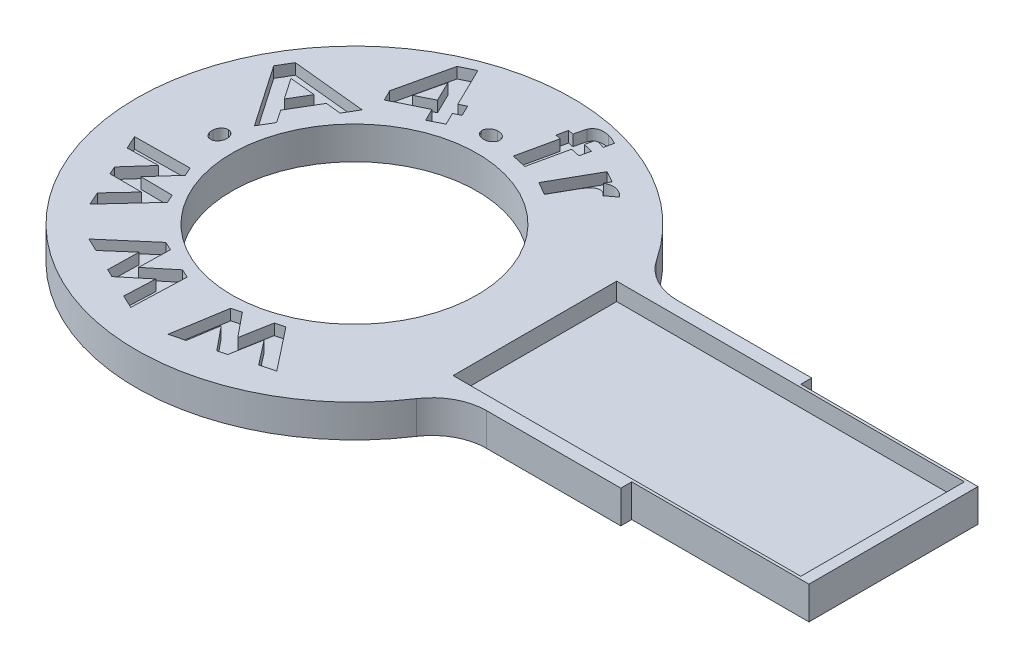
from build123d import *

# Parameters (mm, degrees)
BOSS_EXTRU_1_DEPTH      = 2.4
ESQUISSE2_W             = 25.5
ESQUISSE2_H             = 12
ENL_V_MAT_EXTRU_1_DEPTH = 1.3
ESQUISSE3_R             = 9
ENL_V_MAT_EXTRU_2_DEPTH = 35.559151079
ENL_V_MAT_EXTRU_3_DEPTH = 0.8
CONG_1_R                = 4


with BuildPart() as part:
    # Esquisse1 → Boss.-Extru.1 (new body)
    with BuildSketch(Plane(origin=(0, 0, 0), x_dir=(1, 0, 0), z_dir=(0, 1, 0))):
        with BuildLine():
            Line((25, 6.2), (25, -6.2))
            Line((25, -6.2), (12, -6.2))
            Line((12, -6.2), (12, -7))
            Line((12, -7), (-0.150595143, -7))
            ThreePointArc((-0.150595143, -7), (-30.538089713, 0), (-0.150595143, 7))
            Line((-0.150595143, 7), (12, 7))
            Line((12, 7), (12, 6.2))
            Line((12, 6.2), (25, 6.2))
        make_face()
    extrude(amount=-BOSS_EXTRU_1_DEPTH)

    # Esquisse2 → Enl_v. mat.-Extru.1 (cut)
    with BuildSketch(Plane(origin=(0, 0, 0), x_dir=(1, 0, 0), z_dir=(0, 1, 0))):
        with Locations((11.45, 0)):
            Rectangle(ESQUISSE2_W, ESQUISSE2_H)
    extrude(amount=-ENL_V_MAT_EXTRU_1_DEPTH, mode=Mode.SUBTRACT)

    # Esquisse3 → Enl_v. mat.-Extru.2 (cut, through all)
    with BuildSketch(Plane(origin=(0, 0, 0), x_dir=(1, 0, 0), z_dir=(0, 1, 0))):
        with Locations(Location((-14.538089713, 0, 0), (0, 0, 270))):
            Circle(ESQUISSE3_R)
    extrude(amount=-ENL_V_MAT_EXTRU_2_DEPTH, mode=Mode.SUBTRACT)

    # Esquisse4 → Enl_v. mat.-Extru.3 (cut)
    # profile 1 of 9: a face of its own
    with BuildSketch(Plane(origin=(0, 0, 0), x_dir=(1, 0, 0), z_dir=(0, 1, 0))):
        with BuildLine():
            Line((-8.606236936, 12.602438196), (-7.777911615, 12.133688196))
            Line((-7.777911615, 12.133688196), (-8.006277, 11.731043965))
            add(Edge.make_bspline(
                [(-8.006277, 11.731043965), (-7.961465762, 11.75596998), (-7.873407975, 11.80495166), (-7.733124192, 11.856415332), (-7.5896155, 11.885673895), (-7.444633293, 11.894720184), (-7.299841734, 11.88330426), (-7.157653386, 11.853811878), (-7.017942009, 11.807405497), (-6.930657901, 11.761358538), (-6.886485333, 11.738055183)],
                knots=[0, 0, 0, 0, 1.045225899, 2.053955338, 3.034687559, 4.024465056, 5.008386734, 5.989118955, 6.982337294, 8, 8, 8, 8], degree=3))
            add(Edge.make_bspline(
                [(-6.886485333, 11.738055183), (-6.855318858, 11.719009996), (-6.79208697, 11.6803703), (-6.703704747, 11.608791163), (-6.618254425, 11.526932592), (-6.566412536, 11.465135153), (-6.539930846, 11.433568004)],
                knots=[0, 0, 0, 0, 0.943863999, 1.914952, 2.934923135, 4, 4, 4, 4], degree=3))
            Line((-6.539930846, 11.433568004), (-7.232038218, 10.91273467))
            add(Edge.make_bspline(
                [(-7.232038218, 10.91273467), (-7.252975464, 10.938826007), (-7.292250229, 10.987768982), (-7.354261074, 11.051304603), (-7.41214917, 11.103613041), (-7.453360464, 11.129244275), (-7.472422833, 11.141100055)],
                knots=[0, 0, 0, 0, 1.202976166, 2.256581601, 3.193578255, 4, 4, 4, 4], degree=3))
            add(Edge.make_bspline(
                [(-7.472422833, 11.141100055), (-7.490875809, 11.150683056), (-7.527726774, 11.169820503), (-7.587030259, 11.188215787), (-7.647840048, 11.199847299), (-7.710692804, 11.201770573), (-7.775063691, 11.193875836), (-7.841806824, 11.180284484), (-7.910153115, 11.156516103), (-7.981188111, 11.124416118), (-8.054726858, 11.079413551), (-8.130086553, 11.017889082), (-8.208757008, 10.940726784), (-8.289977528, 10.846585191), (-8.373672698, 10.736143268), (-8.460748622, 10.609182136), (-8.551896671, 10.466554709), (-8.610679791, 10.364118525), (-8.641293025, 10.310771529)],
                knots=[0, 0, 0, 0, 0.626750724, 1.251633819, 1.866598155, 2.491968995, 3.141025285, 3.821201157, 4.544887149, 5.320826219, 6.171494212, 7.139779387, 8.251934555, 9.495259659, 10.890575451, 12.434212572, 14.142999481, 16, 16, 16, 16], degree=3))
            Line((-8.641293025, 10.310771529), (-8.726429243, 10.154521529))
            Line((-8.726429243, 10.154521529), (-9.458600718, 8.859449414))
            Line((-9.458600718, 8.859449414), (-10.417134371, 9.401316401))
            Line((-10.417134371, 9.401316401), (-8.606236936, 12.602438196))
        make_face()
    # profile 2 of 9: a face of its own
    with BuildSketch(Plane(origin=(0, 0, 0), x_dir=(1, 0, 0), z_dir=(0, 1, 0))):
        with BuildLine():
            Line((-12.636736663, 13.811610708), (-12.251119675, 13.72647449))
            add(Edge.make_bspline(
                [(-12.251119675, 13.72647449), (-12.238376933, 13.78188322), (-12.214271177, 13.886701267), (-12.180995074, 14.035281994), (-12.148265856, 14.165508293), (-12.120602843, 14.277772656), (-12.097004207, 14.37224839), (-12.074487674, 14.447710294), (-12.057478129, 14.506294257), (-12.044953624, 14.538496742), (-12.039781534, 14.551795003)],
                knots=[0, 0, 0, 0, 1.600764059, 3.028204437, 4.286682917, 5.381007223, 6.283848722, 7.027579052, 7.598431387, 8, 8, 8, 8], degree=3))
            add(Edge.make_bspline(
                [(-12.039781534, 14.551795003), (-12.030221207, 14.575041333), (-12.011503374, 14.620554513), (-11.975766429, 14.684850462), (-11.933877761, 14.74342178), (-11.886617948, 14.797262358), (-11.832810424, 14.844596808), (-11.773521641, 14.886505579), (-11.708702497, 14.924224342), (-11.637779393, 14.955718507), (-11.561342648, 14.982588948), (-11.478745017, 14.999615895), (-11.39112582, 15.012054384), (-11.29829712, 15.016784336), (-11.199978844, 15.014169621), (-11.096173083, 15.00673641), (-10.986978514, 14.990015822), (-10.912918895, 14.975108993), (-10.874917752, 14.967460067)],
                knots=[0, 0, 0, 0, 0.886170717, 1.735002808, 2.587992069, 3.422318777, 4.256645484, 5.109634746, 5.980329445, 6.897576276, 7.843634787, 8.832424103, 9.866809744, 10.963743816, 12.106450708, 13.334979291, 14.632536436, 16, 16, 16, 16], degree=3))
            add(Edge.make_bspline(
                [(-10.874917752, 14.967460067), (-10.81683825, 14.953172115), (-10.696667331, 14.923609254), (-10.516505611, 14.856384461), (-10.328591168, 14.773569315), (-10.204076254, 14.706592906), (-10.13974147, 14.67198731)],
                knots=[0, 0, 0, 0, 0.902164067, 1.866646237, 2.897731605, 4, 4, 4, 4], degree=3))
            Line((-10.13974147, 14.67198731), (-10.289981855, 13.988894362))
            add(Edge.make_bspline(
                [(-10.289981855, 13.988894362), (-10.32562779, 14.005092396), (-10.393165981, 14.035782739), (-10.490445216, 14.076804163), (-10.579516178, 14.107254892), (-10.636769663, 14.121463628), (-10.663579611, 14.128117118)],
                knots=[0, 0, 0, 0, 1.176179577, 2.228502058, 3.170465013, 4, 4, 4, 4], degree=3))
            add(Edge.make_bspline(
                [(-10.663579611, 14.128117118), (-10.693191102, 14.134346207), (-10.748705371, 14.146024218), (-10.827760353, 14.149269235), (-10.896926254, 14.145926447), (-10.936557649, 14.131050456), (-10.955045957, 14.124110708)],
                knots=[0, 0, 0, 0, 1.223562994, 2.293879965, 3.204083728, 4, 4, 4, 4], degree=3))
            add(Edge.make_bspline(
                [(-10.955045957, 14.124110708), (-10.967342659, 14.116449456), (-10.993933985, 14.099882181), (-11.023571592, 14.056806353), (-11.04704931, 14.000379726), (-11.058140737, 13.957378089), (-11.064220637, 13.933806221)],
                knots=[0, 0, 0, 0, 0.761870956, 1.647527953, 2.710463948, 4, 4, 4, 4], degree=3))
            Line((-11.064220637, 13.933806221), (-11.166384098, 13.48809308))
            Line((-11.166384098, 13.48809308), (-10.478283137, 13.336851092))
            Line((-10.478283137, 13.336851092), (-10.645550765, 12.574631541))
            Line((-10.645550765, 12.574631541), (-11.333651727, 12.725873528))
            Line((-11.333651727, 12.725873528), (-11.952642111, 9.912371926))
            Line((-11.952642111, 9.912371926), (-13.037377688, 10.150753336))
            Line((-13.037377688, 10.150753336), (-12.418387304, 12.964254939))
            Line((-12.418387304, 12.964254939), (-12.804004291, 13.049391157))
            Line((-12.804004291, 13.049391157), (-12.636736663, 13.811610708))
        make_face()
    # profile 3 of 9: a face of its own
    with BuildSketch(Plane(origin=(0, 0, 0), x_dir=(1, 0, 0), z_dir=(0, 1, 0))):
        with BuildLine():
            add(Edge.make_bspline(
                [(-15.209833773, 11.179592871), (-15.166996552, 11.180896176), (-15.083660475, 11.183431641), (-14.962435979, 11.159750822), (-14.849433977, 11.118971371), (-14.748098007, 11.057667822), (-14.661242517, 10.983189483), (-14.594564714, 10.895997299), (-14.551589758, 10.797468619), (-14.543065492, 10.727268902), (-14.538760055, 10.691812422)],
                knots=[0, 0, 0, 0, 1.114239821, 2.167656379, 3.197687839, 4.232233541, 5.237809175, 6.163994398, 7.072670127, 8, 8, 8, 8], degree=3))
            add(Edge.make_bspline(
                [(-14.538760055, 10.691812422), (-14.53867055, 10.656224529), (-14.538493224, 10.585718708), (-14.569481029, 10.482832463), (-14.624525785, 10.387537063), (-14.701619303, 10.301991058), (-14.794790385, 10.228073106), (-14.901595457, 10.172541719), (-15.019302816, 10.135297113), (-15.102059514, 10.126458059), (-15.144729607, 10.121900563)],
                knots=[0, 0, 0, 0, 0.922364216, 1.82736434, 2.757761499, 3.767592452, 4.807426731, 5.837699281, 6.88509846, 8, 8, 8, 8], degree=3))
            add(Edge.make_bspline(
                [(-15.144729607, 10.121900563), (-15.187566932, 10.12102134), (-15.270899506, 10.119310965), (-15.392115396, 10.142695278), (-15.505609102, 10.183640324), (-15.607247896, 10.245668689), (-15.694660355, 10.320958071), (-15.759076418, 10.409738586), (-15.804521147, 10.506951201), (-15.812675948, 10.577144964), (-15.816804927, 10.61268582)],
                knots=[0, 0, 0, 0, 1.11224569, 2.163680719, 3.191774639, 4.236294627, 5.245715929, 6.171953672, 7.07441448, 8, 8, 8, 8], degree=3))
            add(Edge.make_bspline(
                [(-15.816804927, 10.61268582), (-15.817095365, 10.648668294), (-15.817666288, 10.719400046), (-15.784311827, 10.821408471), (-15.731629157, 10.917191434), (-15.653744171, 11.001476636), (-15.560340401, 11.074695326), (-15.453181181, 11.129675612), (-15.335355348, 11.167465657), (-15.252521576, 11.175468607), (-15.209833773, 11.179592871)],
                knots=[0, 0, 0, 0, 0.931836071, 1.831736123, 2.758645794, 3.762835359, 4.798192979, 5.837053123, 6.885340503, 8, 8, 8, 8], degree=3))
        make_face()
    # profile 4 of 9: a face of its own
    with BuildSketch(Plane(origin=(0, 0, 0), x_dir=(1, 0, 0), z_dir=(0, 1, 0))):
        Polygon((-20.7974936, 13.78543823), (-19.771852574, 14.287241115), (-18.363599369, 11.412641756), (-17.883831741, 11.648018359), (-17.498214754, 10.860758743), (-17.977982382, 10.625382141), (-17.529264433, 9.708915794), (-18.532870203, 9.217128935), (-18.981588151, 10.133595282), (-21.332349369, 8.981752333), (-21.717966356, 9.769011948), align=None)
        Polygon((-19.367205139, 10.920854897), (-20.100378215, 12.417249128), (-20.59817469, 10.317890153), align=None, mode=Mode.SUBTRACT)
    # profile 5 of 9: a face of its own
    with BuildSketch(Plane(origin=(0, 0, 0), x_dir=(1, 0, 0), z_dir=(0, 1, 0))):
        Polygon((-27.558034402, 7.097131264), (-26.969092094, 8.092724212), (-21.51436453, 7.54484761), (-22.117329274, 6.5252162), (-23.238122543, 6.643405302), (-24.482112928, 4.540039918), (-23.848098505, 3.597531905), (-24.451063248, 2.577900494), align=None)
        Polygon((-26.124741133, 6.930865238), (-25.06103921, 5.374374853), (-24.249741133, 6.745568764), align=None, mode=Mode.SUBTRACT)
    # profile 6 of 9: a face of its own
    with BuildSketch(Plane(origin=(0, 0, 0), x_dir=(1, 0, 0), z_dir=(0, 1, 0))):
        with BuildLine():
            add(Edge.make_bspline(
                [(-25.712984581, 0.782212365), (-25.708540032, 0.824588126), (-25.699910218, 0.906867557), (-25.661044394, 1.023166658), (-25.605915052, 1.129277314), (-25.5318107, 1.220933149), (-25.447113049, 1.298161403), (-25.35137144, 1.35099057), (-25.248451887, 1.381684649), (-25.178000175, 1.380680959), (-25.142071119, 1.380169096)],
                knots=[0, 0, 0, 0, 1.111873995, 2.158884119, 3.186620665, 4.224847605, 5.227438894, 6.165866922, 7.064626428, 8, 8, 8, 8], degree=3))
            add(Edge.make_bspline(
                [(-25.142071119, 1.380169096), (-25.106609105, 1.375496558), (-25.036760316, 1.366293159), (-24.938667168, 1.323137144), (-24.851718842, 1.256685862), (-24.777083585, 1.169872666), (-24.716537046, 1.068484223), (-24.673321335, 0.956589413), (-24.651971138, 0.835431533), (-24.65416702, 0.752562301), (-24.655292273, 0.71009698)],
                knots=[0, 0, 0, 0, 0.931381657, 1.834522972, 2.763242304, 3.771569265, 4.808945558, 5.836692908, 6.89143982, 8, 8, 8, 8], degree=3))
            add(Edge.make_bspline(
                [(-24.655292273, 0.71009698), (-24.659758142, 0.667731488), (-24.668429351, 0.585471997), (-24.707050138, 0.468880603), (-24.763479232, 0.362986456), (-24.838495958, 0.27135119), (-24.923611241, 0.194474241), (-25.019816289, 0.142321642), (-25.122022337, 0.110489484), (-25.192594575, 0.111586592), (-25.22820894, 0.112140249)],
                knots=[0, 0, 0, 0, 1.110992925, 2.157173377, 3.18820508, 4.231066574, 5.239420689, 6.165248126, 7.074090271, 8, 8, 8, 8], degree=3))
            add(Edge.make_bspline(
                [(-25.22820894, 0.112140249), (-25.263688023, 0.116792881), (-25.333570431, 0.125957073), (-25.431662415, 0.169512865), (-25.519593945, 0.234914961), (-25.592862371, 0.322931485), (-25.654626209, 0.423547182), (-25.693987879, 0.536643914), (-25.716593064, 0.657112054), (-25.714210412, 0.739714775), (-25.712984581, 0.782212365)],
                knots=[0, 0, 0, 0, 0.93198946, 1.835720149, 2.77203782, 3.775298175, 4.813351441, 5.843881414, 6.890716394, 8, 8, 8, 8], degree=3))
        make_face()
    # profile 7 of 9: a face of its own
    with BuildSketch(Plane(origin=(0, 0, 0), x_dir=(1, 0, 0), z_dir=(0, 1, 0))):
        Polygon((-25.508080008, -8.429348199), (-25.948785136, -7.443771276), (-24.393296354, -5.776103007), (-26.700988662, -5.763082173), (-26.970419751, -5.161119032), (-25.455996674, -3.459396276), (-27.714610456, -3.498458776), (-28.158320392, -2.505870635), (-24.130876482, -2.462801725), (-23.845419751, -3.101824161), (-25.382879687, -4.818570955), (-23.067174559, -4.841607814), (-22.784722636, -5.473619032), align=None)
    # profile 8 of 9: a face of its own
    with BuildSketch(Plane(origin=(0, 0, 0), x_dir=(1, 0, 0), z_dir=(0, 1, 0))):
        Polygon((-17.456452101, -13.494176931), (-18.434016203, -13.026428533), (-18.335859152, -10.762806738), (-20.10068287, -12.227149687), (-20.697637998, -11.941692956), (-20.653567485, -9.678071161), (-22.345274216, -11.151428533), (-23.330851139, -10.679673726), (-20.293992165, -8.073503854), (-19.660979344, -8.376989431), (-19.712061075, -10.66565129), (-17.936219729, -9.203311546), (-17.309216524, -9.503792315), align=None)
    # profile 9 of 9: a face of its own
    with BuildSketch(Plane(origin=(0, 0, 0), x_dir=(1, 0, 0), z_dir=(0, 1, 0))):
        Polygon((-8.052760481, -12.183863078), (-9.105444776, -12.45830218), (-10.494667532, -10.668438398), (-10.900316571, -12.926050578), (-11.543345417, -13.093318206), (-12.972632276, -11.338510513), (-13.31818516, -13.55605859), (-14.378882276, -13.832500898), (-13.73585343, -9.883181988), (-13.052760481, -9.704896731), (-11.612455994, -11.484744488), (-11.195789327, -9.221122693), (-10.520709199, -9.044840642), align=None)
    extrude(amount=-ENL_V_MAT_EXTRU_3_DEPTH, mode=Mode.SUBTRACT)

    # Cong_1
    cong_1_edges = [part.edges().sort_by_distance(p)[0] for p in [
        (-0.150595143, -1.2, 7),
        (-0.150595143, -1.2, -7),
    ]]
    fillet(cong_1_edges, radius=CONG_1_R)


solid = part.part
